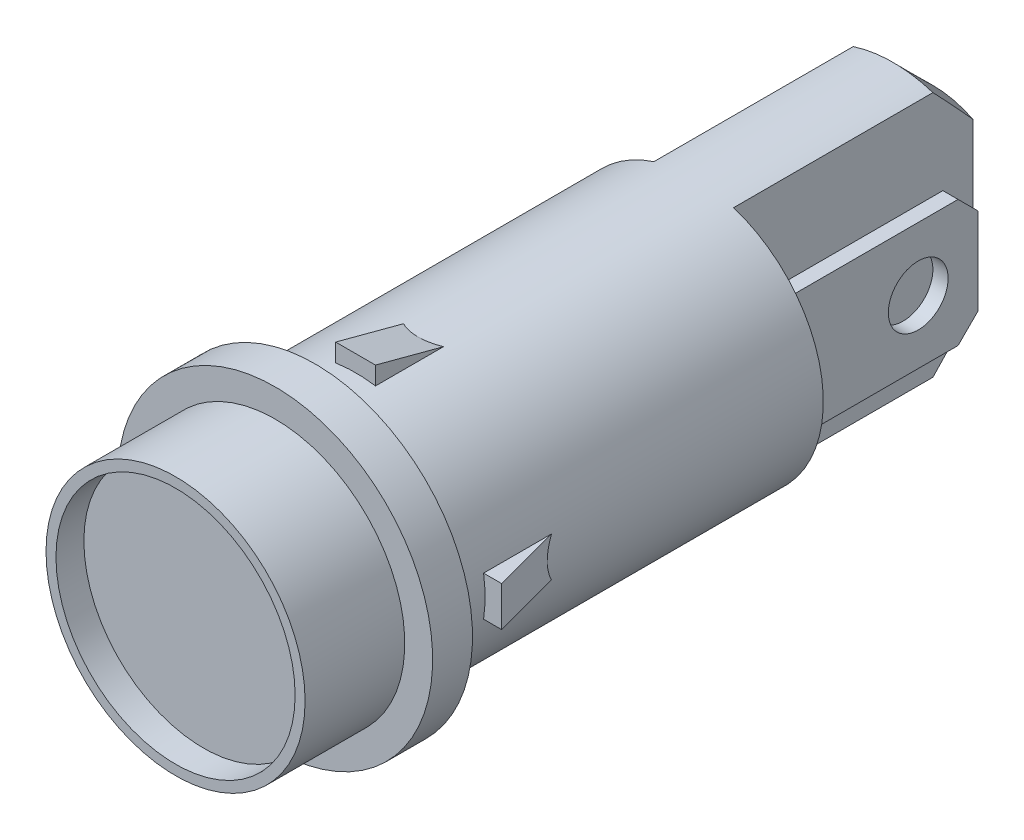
ISO-10303-21;
HEADER;
FILE_DESCRIPTION(('STEP AP214'),'2;1');
FILE_NAME('part.step','',(''),(''),'','','');
FILE_SCHEMA(('AUTOMOTIVE_DESIGN { 1 0 10303 214 1 1 1 1 }'));
ENDSEC;
DATA;
#1=APPLICATION_CONTEXT('core data for automotive mechanical design processes');
#2=APPLICATION_PROTOCOL_DEFINITION('international standard','automotive_design',2000,#1);
#3=PRODUCT_CONTEXT('',#1,'mechanical');
#4=PRODUCT('Part','Part','',(#3));
#5=PRODUCT_RELATED_PRODUCT_CATEGORY('part','',(#4));
#6=PRODUCT_DEFINITION_FORMATION('','',#4);
#7=PRODUCT_DEFINITION_CONTEXT('part definition',#1,'design');
#8=PRODUCT_DEFINITION('design','',#6,#7);
#9=PRODUCT_DEFINITION_SHAPE('','',#8);
#10=(LENGTH_UNIT() NAMED_UNIT(*) SI_UNIT(.MILLI.,.METRE.));
#11=(NAMED_UNIT(*) PLANE_ANGLE_UNIT() SI_UNIT($,.RADIAN.));
#12=(NAMED_UNIT(*) SI_UNIT($,.STERADIAN.) SOLID_ANGLE_UNIT());
#13=UNCERTAINTY_MEASURE_WITH_UNIT(LENGTH_MEASURE(1.E-05),#10,'distance_accuracy_value','');
#14=(GEOMETRIC_REPRESENTATION_CONTEXT(3) GLOBAL_UNCERTAINTY_ASSIGNED_CONTEXT((#13)) GLOBAL_UNIT_ASSIGNED_CONTEXT((#10,
#11,#12)) REPRESENTATION_CONTEXT('',''));
#15=CARTESIAN_POINT('',(0.,0.,0.));
#16=DIRECTION('',(0.,0.,1.));
#17=DIRECTION('',(1.,0.,0.));
#18=AXIS2_PLACEMENT_3D('',#15,#16,#17);
#19=CARTESIAN_POINT('',(-4.262,3.175,2.));
#20=DIRECTION('',(-1.,0.,0.));
#21=DIRECTION('',(0.,0.,1.));
#22=AXIS2_PLACEMENT_3D('',#19,#20,#21);
#23=PLANE('',#22);
#24=DIRECTION('',(0.,-1.,0.));
#25=VECTOR('',#24,1.);
#26=CARTESIAN_POINT('',(-4.262,3.175,2.));
#27=LINE('',#26,#25);
#28=CARTESIAN_POINT('',(-4.262,2.17499999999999,2.));
#29=VERTEX_POINT('',#28);
#30=CARTESIAN_POINT('',(-4.262,-2.175,2.));
#31=VERTEX_POINT('',#30);
#32=EDGE_CURVE('E319',#29,#31,#27,.T.);
#33=ORIENTED_EDGE('',*,*,#32,.T.);
#34=DIRECTION('',(0.,0.707106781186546,-0.707106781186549));
#35=VECTOR('',#34,1.);
#36=CARTESIAN_POINT('',(-4.262,0.499999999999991,-0.675));
#37=LINE('',#36,#35);
#38=CARTESIAN_POINT('',(-4.262,-3.175,3.));
#39=VERTEX_POINT('',#38);
#40=EDGE_CURVE('E435',#31,#39,#37,.F.);
#41=ORIENTED_EDGE('',*,*,#40,.T.);
#42=DIRECTION('',(0.,0.,1.));
#43=VECTOR('',#42,1.);
#44=CARTESIAN_POINT('',(-4.262,-3.175,2.));
#45=LINE('',#44,#43);
#46=CARTESIAN_POINT('',(-4.262,-3.175,12.));
#47=VERTEX_POINT('',#46);
#48=EDGE_CURVE('E325',#39,#47,#45,.T.);
#49=ORIENTED_EDGE('',*,*,#48,.T.);
#50=DIRECTION('',(0.,-1.,0.));
#51=VECTOR('',#50,1.);
#52=CARTESIAN_POINT('',(-4.262,3.175,12.));
#53=LINE('',#52,#51);
#54=CARTESIAN_POINT('',(-4.262,3.175,12.));
#55=VERTEX_POINT('',#54);
#56=EDGE_CURVE('E307',#55,#47,#53,.T.);
#57=ORIENTED_EDGE('',*,*,#56,.F.);
#58=DIRECTION('',(0.,0.,1.));
#59=VECTOR('',#58,1.);
#60=CARTESIAN_POINT('',(-4.262,3.175,2.));
#61=LINE('',#60,#59);
#62=CARTESIAN_POINT('',(-4.262,3.175,3.00000000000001));
#63=VERTEX_POINT('',#62);
#64=EDGE_CURVE('E331',#63,#55,#61,.T.);
#65=ORIENTED_EDGE('',*,*,#64,.F.);
#66=DIRECTION('',(0.,0.707106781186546,0.707106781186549));
#67=VECTOR('',#66,1.);
#68=CARTESIAN_POINT('',(-4.262,2.67499999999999,2.5));
#69=LINE('',#68,#67);
#70=EDGE_CURVE('E433',#63,#29,#69,.F.);
#71=ORIENTED_EDGE('',*,*,#70,.T.);
#72=EDGE_LOOP('',(#33,#41,#49,#57,#65,#71));
#73=FACE_BOUND('',#72,.T.);
#74=CARTESIAN_POINT('',(-4.262,0.,5.));
#75=DIRECTION('',(1.,0.,0.));
#76=DIRECTION('',(0.,0.,-1.));
#77=AXIS2_PLACEMENT_3D('',#74,#75,#76);
#78=CIRCLE('',#77,1.5);
#79=CARTESIAN_POINT('',(-4.262,0.,3.5));
#80=VERTEX_POINT('',#79);
#81=EDGE_CURVE('E301',#80,#80,#78,.T.);
#82=ORIENTED_EDGE('',*,*,#81,.T.);
#83=EDGE_LOOP('',(#82));
#84=FACE_BOUND('',#83,.T.);
#85=ADVANCED_FACE('F42',(#73,#84),#23,.T.);
#86=CARTESIAN_POINT('',(-3.5,3.175,2.));
#87=DIRECTION('',(1.,0.,0.));
#88=DIRECTION('',(0.,0.,-1.));
#89=AXIS2_PLACEMENT_3D('',#86,#87,#88);
#90=PLANE('',#89);
#91=DIRECTION('',(0.,0.,1.));
#92=VECTOR('',#91,1.);
#93=CARTESIAN_POINT('',(-3.5,-3.175,2.));
#94=LINE('',#93,#92);
#95=CARTESIAN_POINT('',(-3.5,-3.175,3.));
#96=VERTEX_POINT('',#95);
#97=CARTESIAN_POINT('',(-3.5,-3.175,12.));
#98=VERTEX_POINT('',#97);
#99=EDGE_CURVE('E327',#96,#98,#94,.T.);
#100=ORIENTED_EDGE('',*,*,#99,.F.);
#101=DIRECTION('',(0.,-0.707106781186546,0.707106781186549));
#102=VECTOR('',#101,1.);
#103=CARTESIAN_POINT('',(-3.5,0.49999999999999,-0.674999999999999));
#104=LINE('',#103,#102);
#105=CARTESIAN_POINT('',(-3.5,-2.175,2.));
#106=VERTEX_POINT('',#105);
#107=EDGE_CURVE('E427',#96,#106,#104,.F.);
#108=ORIENTED_EDGE('',*,*,#107,.T.);
#109=DIRECTION('',(0.,1.,0.));
#110=VECTOR('',#109,1.);
#111=CARTESIAN_POINT('',(-3.5,3.175,2.));
#112=LINE('',#111,#110);
#113=CARTESIAN_POINT('',(-3.5,2.17499999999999,2.));
#114=VERTEX_POINT('',#113);
#115=EDGE_CURVE('E322',#106,#114,#112,.T.);
#116=ORIENTED_EDGE('',*,*,#115,.T.);
#117=DIRECTION('',(0.,-0.707106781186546,-0.707106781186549));
#118=VECTOR('',#117,1.);
#119=CARTESIAN_POINT('',(-3.5,2.67499999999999,2.5));
#120=LINE('',#119,#118);
#121=CARTESIAN_POINT('',(-3.5,3.175,3.00000000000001));
#122=VERTEX_POINT('',#121);
#123=EDGE_CURVE('E425',#114,#122,#120,.F.);
#124=ORIENTED_EDGE('',*,*,#123,.T.);
#125=DIRECTION('',(0.,0.,1.));
#126=VECTOR('',#125,1.);
#127=CARTESIAN_POINT('',(-3.5,3.175,2.));
#128=LINE('',#127,#126);
#129=CARTESIAN_POINT('',(-3.5,3.175,12.));
#130=VERTEX_POINT('',#129);
#131=EDGE_CURVE('E329',#122,#130,#128,.T.);
#132=ORIENTED_EDGE('',*,*,#131,.T.);
#133=DIRECTION('',(0.,1.,0.));
#134=VECTOR('',#133,1.);
#135=CARTESIAN_POINT('',(-3.5,3.175,12.));
#136=LINE('',#135,#134);
#137=EDGE_CURVE('E313',#98,#130,#136,.T.);
#138=ORIENTED_EDGE('',*,*,#137,.F.);
#139=EDGE_LOOP('',(#100,#108,#116,#124,#132,#138));
#140=FACE_BOUND('',#139,.T.);
#141=CARTESIAN_POINT('',(-3.5,0.,5.));
#142=DIRECTION('',(1.,0.,0.));
#143=DIRECTION('',(0.,0.,-1.));
#144=AXIS2_PLACEMENT_3D('',#141,#142,#143);
#145=CIRCLE('',#144,1.5);
#146=CARTESIAN_POINT('',(-3.5,0.,3.5));
#147=VERTEX_POINT('',#146);
#148=EDGE_CURVE('E304',#147,#147,#145,.T.);
#149=ORIENTED_EDGE('',*,*,#148,.F.);
#150=EDGE_LOOP('',(#149));
#151=FACE_BOUND('',#150,.T.);
#152=ADVANCED_FACE('F500',(#140,#151),#90,.T.);
#153=CARTESIAN_POINT('',(2.,-7.9,12.));
#154=DIRECTION('',(0.,0.,1.));
#155=DIRECTION('',(1.,0.,0.));
#156=AXIS2_PLACEMENT_3D('',#153,#154,#155);
#157=PLANE('',#156);
#158=CARTESIAN_POINT('',(0.,0.,12.));
#159=DIRECTION('',(0.,0.,1.));
#160=DIRECTION('',(1.,0.,0.));
#161=AXIS2_PLACEMENT_3D('',#158,#159,#160);
#162=CIRCLE('',#161,6.5);
#163=CARTESIAN_POINT('',(2.,-6.18465843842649,12.));
#164=VERTEX_POINT('',#163);
#165=CARTESIAN_POINT('',(2.,6.18465843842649,12.));
#166=VERTEX_POINT('',#165);
#167=EDGE_CURVE('E389',#164,#166,#162,.T.);
#168=ORIENTED_EDGE('',*,*,#167,.F.);
#169=DIRECTION('',(0.,1.,0.));
#170=VECTOR('',#169,1.);
#171=CARTESIAN_POINT('',(2.,-7.9,12.));
#172=LINE('',#171,#170);
#173=EDGE_CURVE('E369',#164,#166,#172,.T.);
#174=ORIENTED_EDGE('',*,*,#173,.T.);
#175=EDGE_LOOP('',(#168,#174));
#176=FACE_BOUND('',#175,.T.);
#177=DIRECTION('',(0.,-1.,0.));
#178=VECTOR('',#177,1.);
#179=CARTESIAN_POINT('',(4.262,3.175,12.));
#180=LINE('',#179,#178);
#181=CARTESIAN_POINT('',(4.262,3.175,12.));
#182=VERTEX_POINT('',#181);
#183=CARTESIAN_POINT('',(4.262,-3.175,12.));
#184=VERTEX_POINT('',#183);
#185=EDGE_CURVE('E339',#182,#184,#180,.T.);
#186=ORIENTED_EDGE('',*,*,#185,.F.);
#187=DIRECTION('',(1.,0.,0.));
#188=VECTOR('',#187,1.);
#189=CARTESIAN_POINT('',(4.262,3.175,12.));
#190=LINE('',#189,#188);
#191=CARTESIAN_POINT('',(3.5,3.175,12.));
#192=VERTEX_POINT('',#191);
#193=EDGE_CURVE('E348',#192,#182,#190,.T.);
#194=ORIENTED_EDGE('',*,*,#193,.F.);
#195=DIRECTION('',(0.,1.,0.));
#196=VECTOR('',#195,1.);
#197=CARTESIAN_POINT('',(3.5,3.175,12.));
#198=LINE('',#197,#196);
#199=CARTESIAN_POINT('',(3.5,-3.175,12.));
#200=VERTEX_POINT('',#199);
#201=EDGE_CURVE('E345',#200,#192,#198,.T.);
#202=ORIENTED_EDGE('',*,*,#201,.F.);
#203=DIRECTION('',(-1.,0.,0.));
#204=VECTOR('',#203,1.);
#205=CARTESIAN_POINT('',(4.262,-3.175,12.));
#206=LINE('',#205,#204);
#207=EDGE_CURVE('E342',#184,#200,#206,.T.);
#208=ORIENTED_EDGE('',*,*,#207,.F.);
#209=EDGE_LOOP('',(#186,#194,#202,#208));
#210=FACE_BOUND('',#209,.T.);
#211=ADVANCED_FACE('F469',(#176,#210),#157,.F.);
#212=CARTESIAN_POINT('',(0.,0.,36.6));
#213=DIRECTION('',(0.,0.,-1.));
#214=DIRECTION('',(-1.,0.,0.));
#215=AXIS2_PLACEMENT_3D('',#212,#213,#214);
#216=CYLINDRICAL_SURFACE('',#215,6.5);
#217=CARTESIAN_POINT('',(0.,0.,33.));
#218=DIRECTION('',(0.,0.,-1.));
#219=DIRECTION('',(-1.,0.,0.));
#220=AXIS2_PLACEMENT_3D('',#217,#218,#219);
#221=CIRCLE('',#220,6.5);
#222=CARTESIAN_POINT('',(-6.5,0.,33.));
#223=VERTEX_POINT('',#222);
#224=EDGE_CURVE('E386',#223,#223,#221,.T.);
#225=ORIENTED_EDGE('',*,*,#224,.F.);
#226=EDGE_LOOP('',(#225));
#227=FACE_BOUND('',#226,.T.);
#228=CARTESIAN_POINT('',(0.,0.,38.));
#229=DIRECTION('',(0.,0.,1.));
#230=DIRECTION('',(1.,0.,0.));
#231=AXIS2_PLACEMENT_3D('',#228,#229,#230);
#232=CIRCLE('',#231,6.5);
#233=CARTESIAN_POINT('',(6.5,0.,38.));
#234=VERTEX_POINT('',#233);
#235=EDGE_CURVE('E246',#234,#234,#232,.T.);
#236=ORIENTED_EDGE('',*,*,#235,.F.);
#237=EDGE_LOOP('',(#236));
#238=FACE_BOUND('',#237,.T.);
#239=ADVANCED_FACE('F480',(#227,#238),#216,.T.);
#240=CARTESIAN_POINT('',(0.,0.,33.));
#241=DIRECTION('',(0.,0.,-1.));
#242=DIRECTION('',(-1.,0.,0.));
#243=AXIS2_PLACEMENT_3D('',#240,#241,#242);
#244=PLANE('',#243);
#245=CARTESIAN_POINT('',(0.,0.,33.));
#246=DIRECTION('',(0.,0.,-1.));
#247=DIRECTION('',(-1.,0.,0.));
#248=AXIS2_PLACEMENT_3D('',#245,#246,#247);
#249=CIRCLE('',#248,7.9);
#250=CARTESIAN_POINT('',(-7.9,0.,33.));
#251=VERTEX_POINT('',#250);
#252=EDGE_CURVE('E380',#251,#251,#249,.T.);
#253=ORIENTED_EDGE('',*,*,#252,.F.);
#254=EDGE_LOOP('',(#253));
#255=FACE_BOUND('',#254,.T.);
#256=ORIENTED_EDGE('',*,*,#224,.T.);
#257=EDGE_LOOP('',(#256));
#258=FACE_BOUND('',#257,.T.);
#259=ADVANCED_FACE('F476',(#255,#258),#244,.F.);
#260=CARTESIAN_POINT('',(0.,0.,31.));
#261=DIRECTION('',(0.,0.,-1.));
#262=DIRECTION('',(-1.,0.,0.));
#263=AXIS2_PLACEMENT_3D('',#260,#261,#262);
#264=PLANE('',#263);
#265=CARTESIAN_POINT('',(0.,0.,31.));
#266=DIRECTION('',(0.,0.,-1.));
#267=DIRECTION('',(-1.,0.,0.));
#268=AXIS2_PLACEMENT_3D('',#265,#266,#267);
#269=CIRCLE('',#268,7.9);
#270=CARTESIAN_POINT('',(-7.9,0.,31.));
#271=VERTEX_POINT('',#270);
#272=EDGE_CURVE('E375',#271,#271,#269,.T.);
#273=ORIENTED_EDGE('',*,*,#272,.T.);
#274=EDGE_LOOP('',(#273));
#275=FACE_BOUND('',#274,.T.);
#276=CARTESIAN_POINT('',(0.,0.,31.));
#277=DIRECTION('',(0.,0.,-1.));
#278=DIRECTION('',(-1.,0.,0.));
#279=AXIS2_PLACEMENT_3D('',#276,#277,#278);
#280=CIRCLE('',#279,6.5);
#281=CARTESIAN_POINT('',(-6.5,0.,31.));
#282=VERTEX_POINT('',#281);
#283=EDGE_CURVE('E383',#282,#282,#280,.T.);
#284=ORIENTED_EDGE('',*,*,#283,.F.);
#285=EDGE_LOOP('',(#284));
#286=FACE_BOUND('',#285,.T.);
#287=ADVANCED_FACE('F471',(#275,#286),#264,.T.);
#288=CARTESIAN_POINT('',(0.,0.,33.));
#289=DIRECTION('',(0.,0.,-1.));
#290=DIRECTION('',(-1.,0.,0.));
#291=AXIS2_PLACEMENT_3D('',#288,#289,#290);
#292=CYLINDRICAL_SURFACE('',#291,7.9);
#293=ORIENTED_EDGE('',*,*,#252,.T.);
#294=EDGE_LOOP('',(#293));
#295=FACE_BOUND('',#294,.T.);
#296=ORIENTED_EDGE('',*,*,#272,.F.);
#297=EDGE_LOOP('',(#296));
#298=FACE_BOUND('',#297,.T.);
#299=ADVANCED_FACE('F475',(#295,#298),#292,.T.);
#300=CARTESIAN_POINT('',(0.,0.,0.));
#301=DIRECTION('',(0.,0.,1.));
#302=DIRECTION('',(1.,0.,0.));
#303=AXIS2_PLACEMENT_3D('',#300,#301,#302);
#304=PLANE('',#303);
#305=DIRECTION('',(0.,1.,0.));
#306=VECTOR('',#305,1.);
#307=CARTESIAN_POINT('',(2.,-7.9,0.));
#308=LINE('',#307,#306);
#309=CARTESIAN_POINT('',(2.,-4.03112887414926,0.));
#310=VERTEX_POINT('',#309);
#311=CARTESIAN_POINT('',(2.,4.03112887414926,0.));
#312=VERTEX_POINT('',#311);
#313=EDGE_CURVE('E372',#310,#312,#308,.T.);
#314=ORIENTED_EDGE('',*,*,#313,.F.);
#315=CARTESIAN_POINT('',(0.,0.,0.));
#316=DIRECTION('',(0.,0.,1.));
#317=DIRECTION('',(1.,0.,0.));
#318=AXIS2_PLACEMENT_3D('',#315,#316,#317);
#319=CIRCLE('',#318,4.49999999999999);
#320=CARTESIAN_POINT('',(-2.,-4.03112887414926,0.));
#321=VERTEX_POINT('',#320);
#322=EDGE_CURVE('E622',#310,#321,#319,.F.);
#323=ORIENTED_EDGE('',*,*,#322,.T.);
#324=DIRECTION('',(0.,1.,0.));
#325=VECTOR('',#324,1.);
#326=CARTESIAN_POINT('',(-2.,-7.9,0.));
#327=LINE('',#326,#325);
#328=CARTESIAN_POINT('',(-2.,4.03112887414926,0.));
#329=VERTEX_POINT('',#328);
#330=EDGE_CURVE('E366',#321,#329,#327,.T.);
#331=ORIENTED_EDGE('',*,*,#330,.T.);
#332=CARTESIAN_POINT('',(0.,0.,0.));
#333=DIRECTION('',(0.,0.,1.));
#334=DIRECTION('',(1.,0.,0.));
#335=AXIS2_PLACEMENT_3D('',#332,#333,#334);
#336=CIRCLE('',#335,4.49999999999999);
#337=EDGE_CURVE('E624',#329,#312,#336,.F.);
#338=ORIENTED_EDGE('',*,*,#337,.T.);
#339=EDGE_LOOP('',(#314,#323,#331,#338));
#340=FACE_BOUND('',#339,.T.);
#341=ADVANCED_FACE('F484',(#340),#304,.F.);
#342=CARTESIAN_POINT('',(0.,0.,28.968));
#343=DIRECTION('',(0.,0.,-1.));
#344=DIRECTION('',(0.,1.,0.));
#345=AXIS2_PLACEMENT_3D('',#342,#343,#344);
#346=CIRCLE('',#345,6.5);
#347=CARTESIAN_POINT('',(-0.999999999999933,6.42261628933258,28.968));
#348=VERTEX_POINT('',#347);
#349=CARTESIAN_POINT('',(1.00000000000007,6.42261628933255,28.968));
#350=VERTEX_POINT('',#349);
#351=EDGE_CURVE('E57',#348,#350,#346,.T.);
#352=ORIENTED_EDGE('',*,*,#351,.F.);
#353=DIRECTION('',(0.,0.,-1.));
#354=VECTOR('',#353,1.);
#355=CARTESIAN_POINT('',(-0.999999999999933,6.42261628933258,36.6));
#356=LINE('',#355,#354);
#357=CARTESIAN_POINT('',(-0.999999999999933,6.42261628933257,25.5591735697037));
#358=VERTEX_POINT('',#357);
#359=EDGE_CURVE('E50',#348,#358,#356,.T.);
#360=ORIENTED_EDGE('',*,*,#359,.T.);
#361=CARTESIAN_POINT('',(0.,0.,1.42256719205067));
#362=DIRECTION('',(0.,-0.966372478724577,0.257146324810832));
#363=DIRECTION('',(0.,-0.257146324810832,-0.966372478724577));
#364=AXIS2_PLACEMENT_3D('',#361,#362,#363);
#365=ELLIPSE('',#364,25.2774369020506,6.5);
#366=CARTESIAN_POINT('',(1.00000000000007,6.42261628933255,25.5591735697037));
#367=VERTEX_POINT('',#366);
#368=EDGE_CURVE('E715',#367,#358,#365,.T.);
#369=ORIENTED_EDGE('',*,*,#368,.F.);
#370=DIRECTION('',(0.,0.,-1.));
#371=VECTOR('',#370,1.);
#372=CARTESIAN_POINT('',(1.00000000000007,6.42261628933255,36.6));
#373=LINE('',#372,#371);
#374=EDGE_CURVE('E256',#350,#367,#373,.T.);
#375=ORIENTED_EDGE('',*,*,#374,.F.);
#376=EDGE_LOOP('',(#352,#360,#369,#375));
#377=FACE_BOUND('',#376,.T.);
#378=CARTESIAN_POINT('',(0.,0.,28.968));
#379=DIRECTION('',(0.,0.,-1.));
#380=DIRECTION('',(-1.,0.,0.));
#381=AXIS2_PLACEMENT_3D('',#378,#379,#380);
#382=CIRCLE('',#381,6.5);
#383=CARTESIAN_POINT('',(-6.42261628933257,-0.999999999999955,28.968));
#384=VERTEX_POINT('',#383);
#385=CARTESIAN_POINT('',(-6.42261628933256,1.00000000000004,28.968));
#386=VERTEX_POINT('',#385);
#387=EDGE_CURVE('E666',#384,#386,#382,.T.);
#388=ORIENTED_EDGE('',*,*,#387,.F.);
#389=DIRECTION('',(0.,0.,-1.));
#390=VECTOR('',#389,1.);
#391=CARTESIAN_POINT('',(-6.42261628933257,-0.999999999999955,36.6));
#392=LINE('',#391,#390);
#393=CARTESIAN_POINT('',(-6.42261628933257,-0.999999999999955,25.5591735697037));
#394=VERTEX_POINT('',#393);
#395=EDGE_CURVE('E712',#384,#394,#392,.T.);
#396=ORIENTED_EDGE('',*,*,#395,.T.);
#397=CARTESIAN_POINT('',(0.,0.,1.42256719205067));
#398=DIRECTION('',(0.966372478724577,0.,0.257146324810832));
#399=DIRECTION('',(0.257146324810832,0.,-0.966372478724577));
#400=AXIS2_PLACEMENT_3D('',#397,#398,#399);
#401=ELLIPSE('',#400,25.2774369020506,6.5);
#402=CARTESIAN_POINT('',(-6.42261628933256,1.00000000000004,25.5591735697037));
#403=VERTEX_POINT('',#402);
#404=EDGE_CURVE('E708',#403,#394,#401,.T.);
#405=ORIENTED_EDGE('',*,*,#404,.F.);
#406=DIRECTION('',(0.,0.,-1.));
#407=VECTOR('',#406,1.);
#408=CARTESIAN_POINT('',(-6.42261628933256,1.00000000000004,36.6));
#409=LINE('',#408,#407);
#410=EDGE_CURVE('E705',#386,#403,#409,.T.);
#411=ORIENTED_EDGE('',*,*,#410,.F.);
#412=EDGE_LOOP('',(#388,#396,#405,#411));
#413=FACE_BOUND('',#412,.T.);
#414=CARTESIAN_POINT('',(0.,0.,28.968));
#415=DIRECTION('',(0.,0.,-1.));
#416=DIRECTION('',(0.,1.,0.));
#417=AXIS2_PLACEMENT_3D('',#414,#415,#416);
#418=CIRCLE('',#417,6.5);
#419=CARTESIAN_POINT('',(0.999999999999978,-6.42261628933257,28.968));
#420=VERTEX_POINT('',#419);
#421=CARTESIAN_POINT('',(-1.00000000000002,-6.42261628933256,28.968));
#422=VERTEX_POINT('',#421);
#423=EDGE_CURVE('E670',#420,#422,#418,.T.);
#424=ORIENTED_EDGE('',*,*,#423,.F.);
#425=DIRECTION('',(0.,0.,-1.));
#426=VECTOR('',#425,1.);
#427=CARTESIAN_POINT('',(0.999999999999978,-6.42261628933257,36.6));
#428=LINE('',#427,#426);
#429=CARTESIAN_POINT('',(0.999999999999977,-6.42261628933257,25.5591735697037));
#430=VERTEX_POINT('',#429);
#431=EDGE_CURVE('E703',#420,#430,#428,.T.);
#432=ORIENTED_EDGE('',*,*,#431,.T.);
#433=CARTESIAN_POINT('',(0.,0.,1.42256719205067));
#434=DIRECTION('',(0.,0.966372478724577,0.257146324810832));
#435=DIRECTION('',(0.,0.257146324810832,-0.966372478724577));
#436=AXIS2_PLACEMENT_3D('',#433,#434,#435);
#437=ELLIPSE('',#436,25.2774369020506,6.5);
#438=CARTESIAN_POINT('',(-1.00000000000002,-6.42261628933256,25.5591735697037));
#439=VERTEX_POINT('',#438);
#440=EDGE_CURVE('E699',#439,#430,#437,.T.);
#441=ORIENTED_EDGE('',*,*,#440,.F.);
#442=DIRECTION('',(0.,0.,-1.));
#443=VECTOR('',#442,1.);
#444=CARTESIAN_POINT('',(-1.00000000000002,-6.42261628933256,36.6));
#445=LINE('',#444,#443);
#446=EDGE_CURVE('E690',#422,#439,#445,.T.);
#447=ORIENTED_EDGE('',*,*,#446,.F.);
#448=EDGE_LOOP('',(#424,#432,#441,#447));
#449=FACE_BOUND('',#448,.T.);
#450=CARTESIAN_POINT('',(0.,0.,28.968));
#451=DIRECTION('',(0.,0.,-1.));
#452=DIRECTION('',(-1.,0.,0.));
#453=AXIS2_PLACEMENT_3D('',#450,#451,#452);
#454=CIRCLE('',#453,6.5);
#455=CARTESIAN_POINT('',(6.42261628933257,1.,28.968));
#456=VERTEX_POINT('',#455);
#457=CARTESIAN_POINT('',(6.42261628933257,-1.,28.968));
#458=VERTEX_POINT('',#457);
#459=EDGE_CURVE('E674',#456,#458,#454,.T.);
#460=ORIENTED_EDGE('',*,*,#459,.F.);
#461=DIRECTION('',(0.,0.,-1.));
#462=VECTOR('',#461,1.);
#463=CARTESIAN_POINT('',(6.42261628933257,1.,36.6));
#464=LINE('',#463,#462);
#465=CARTESIAN_POINT('',(6.42261628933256,1.,25.5591735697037));
#466=VERTEX_POINT('',#465);
#467=EDGE_CURVE('E678',#456,#466,#464,.T.);
#468=ORIENTED_EDGE('',*,*,#467,.T.);
#469=CARTESIAN_POINT('',(0.,0.,1.42256719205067));
#470=DIRECTION('',(-0.966372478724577,0.,0.257146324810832));
#471=DIRECTION('',(-0.257146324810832,0.,-0.966372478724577));
#472=AXIS2_PLACEMENT_3D('',#469,#470,#471);
#473=ELLIPSE('',#472,25.2774369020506,6.5);
#474=CARTESIAN_POINT('',(6.42261628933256,-1.,25.5591735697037));
#475=VERTEX_POINT('',#474);
#476=EDGE_CURVE('E684',#475,#466,#473,.T.);
#477=ORIENTED_EDGE('',*,*,#476,.F.);
#478=DIRECTION('',(0.,0.,-1.));
#479=VECTOR('',#478,1.);
#480=CARTESIAN_POINT('',(6.42261628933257,-1.,36.6));
#481=LINE('',#480,#479);
#482=EDGE_CURVE('E561',#458,#475,#481,.T.);
#483=ORIENTED_EDGE('',*,*,#482,.F.);
#484=EDGE_LOOP('',(#460,#468,#477,#483));
#485=FACE_BOUND('',#484,.T.);
#486=ORIENTED_EDGE('',*,*,#283,.T.);
#487=EDGE_LOOP('',(#486));
#488=FACE_BOUND('',#487,.T.);
#489=DIRECTION('',(0.,0.,-1.));
#490=VECTOR('',#489,1.);
#491=CARTESIAN_POINT('',(-2.00000000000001,-6.18465843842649,36.6));
#492=LINE('',#491,#490);
#493=CARTESIAN_POINT('',(-2.,-6.18465843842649,12.));
#494=VERTEX_POINT('',#493);
#495=CARTESIAN_POINT('',(-2.00000000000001,-6.18465843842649,2.));
#496=VERTEX_POINT('',#495);
#497=EDGE_CURVE('E399',#494,#496,#492,.T.);
#498=ORIENTED_EDGE('',*,*,#497,.T.);
#499=CARTESIAN_POINT('',(0.,0.,2.));
#500=DIRECTION('',(0.,0.,1.));
#501=DIRECTION('',(1.,0.,0.));
#502=AXIS2_PLACEMENT_3D('',#499,#500,#501);
#503=CIRCLE('',#502,6.5);
#504=CARTESIAN_POINT('',(2.00000000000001,-6.18465843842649,2.));
#505=VERTEX_POINT('',#504);
#506=EDGE_CURVE('E443',#496,#505,#503,.T.);
#507=ORIENTED_EDGE('',*,*,#506,.T.);
#508=DIRECTION('',(0.,0.,-1.));
#509=VECTOR('',#508,1.);
#510=CARTESIAN_POINT('',(2.00000000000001,-6.18465843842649,36.6));
#511=LINE('',#510,#509);
#512=EDGE_CURVE('E391',#505,#164,#511,.F.);
#513=ORIENTED_EDGE('',*,*,#512,.T.);
#514=ORIENTED_EDGE('',*,*,#167,.T.);
#515=DIRECTION('',(0.,0.,-1.));
#516=VECTOR('',#515,1.);
#517=CARTESIAN_POINT('',(2.00000000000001,6.18465843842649,36.6));
#518=LINE('',#517,#516);
#519=CARTESIAN_POINT('',(2.00000000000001,6.18465843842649,2.));
#520=VERTEX_POINT('',#519);
#521=EDGE_CURVE('E393',#166,#520,#518,.T.);
#522=ORIENTED_EDGE('',*,*,#521,.T.);
#523=CARTESIAN_POINT('',(0.,0.,2.));
#524=DIRECTION('',(0.,0.,1.));
#525=DIRECTION('',(1.,0.,0.));
#526=AXIS2_PLACEMENT_3D('',#523,#524,#525);
#527=CIRCLE('',#526,6.5);
#528=CARTESIAN_POINT('',(-2.00000000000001,6.18465843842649,2.));
#529=VERTEX_POINT('',#528);
#530=EDGE_CURVE('E440',#520,#529,#527,.T.);
#531=ORIENTED_EDGE('',*,*,#530,.T.);
#532=DIRECTION('',(0.,0.,-1.));
#533=VECTOR('',#532,1.);
#534=CARTESIAN_POINT('',(-2.00000000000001,6.18465843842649,36.6));
#535=LINE('',#534,#533);
#536=CARTESIAN_POINT('',(-2.,6.18465843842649,12.));
#537=VERTEX_POINT('',#536);
#538=EDGE_CURVE('E402',#529,#537,#535,.F.);
#539=ORIENTED_EDGE('',*,*,#538,.T.);
#540=CARTESIAN_POINT('',(0.,0.,12.));
#541=DIRECTION('',(0.,0.,1.));
#542=DIRECTION('',(1.,0.,0.));
#543=AXIS2_PLACEMENT_3D('',#540,#541,#542);
#544=CIRCLE('',#543,6.5);
#545=EDGE_CURVE('E396',#537,#494,#544,.T.);
#546=ORIENTED_EDGE('',*,*,#545,.T.);
#547=EDGE_LOOP('',(#498,#507,#513,#514,#522,#531,#539,#546));
#548=FACE_BOUND('',#547,.T.);
#549=ADVANCED_FACE('F44',(#377,#413,#449,#485,#488,#548),#216,.T.);
#550=CARTESIAN_POINT('',(2.,-7.9,0.));
#551=DIRECTION('',(-1.,0.,0.));
#552=DIRECTION('',(0.,0.,1.));
#553=AXIS2_PLACEMENT_3D('',#550,#551,#552);
#554=PLANE('',#553);
#555=ORIENTED_EDGE('',*,*,#512,.F.);
#556=CARTESIAN_POINT('',(2.00000000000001,-6.18465843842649,2.));
#557=CARTESIAN_POINT('',(2.,-6.0072036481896,1.83118359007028));
#558=CARTESIAN_POINT('',(2.,-5.8294320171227,1.66269766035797));
#559=CARTESIAN_POINT('',(2.,-5.47300822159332,1.32667911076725));
#560=CARTESIAN_POINT('',(2.,-5.29435610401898,1.15914644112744));
#561=CARTESIAN_POINT('',(2.,-4.93590106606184,0.825304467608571));
#562=CARTESIAN_POINT('',(2.,-4.75609811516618,0.658995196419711));
#563=CARTESIAN_POINT('',(2.,-4.48522439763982,0.410797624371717));
#564=CARTESIAN_POINT('',(2.,-4.39473587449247,0.328273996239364));
#565=CARTESIAN_POINT('',(2.,-4.21329686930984,0.163734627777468));
#566=CARTESIAN_POINT('',(2.,-4.12234638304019,0.0817188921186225));
#567=CARTESIAN_POINT('',(2.,-4.03112887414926,0.));
#568=B_SPLINE_CURVE_WITH_KNOTS('',3,(#556,#557,#558,#559,#560,#561,#562,#563,#564,#565,#566,
#567),.UNSPECIFIED.,.F.,.F.,(4,2,2,2,2,4),(0.,0.734782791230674,1.46952686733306,
2.20429050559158,2.57169170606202,2.93909628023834),.UNSPECIFIED.);
#569=EDGE_CURVE('E453',#505,#310,#568,.T.);
#570=ORIENTED_EDGE('',*,*,#569,.T.);
#571=ORIENTED_EDGE('',*,*,#313,.T.);
#572=CARTESIAN_POINT('',(2.,4.03112887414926,0.));
#573=CARTESIAN_POINT('',(2.,4.12234638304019,0.0817188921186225));
#574=CARTESIAN_POINT('',(2.,4.21329686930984,0.163734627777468));
#575=CARTESIAN_POINT('',(2.,4.39473587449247,0.328273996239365));
#576=CARTESIAN_POINT('',(2.,4.48522439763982,0.410797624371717));
#577=CARTESIAN_POINT('',(2.,4.75609811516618,0.658995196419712));
#578=CARTESIAN_POINT('',(2.,4.93590106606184,0.825304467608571));
#579=CARTESIAN_POINT('',(2.,5.29435610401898,1.15914644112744));
#580=CARTESIAN_POINT('',(2.,5.47300822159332,1.32667911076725));
#581=CARTESIAN_POINT('',(2.,5.8294320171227,1.66269766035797));
#582=CARTESIAN_POINT('',(2.,6.00720364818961,1.83118359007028));
#583=CARTESIAN_POINT('',(2.,6.18465843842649,2.));
#584=B_SPLINE_CURVE_WITH_KNOTS('',3,(#572,#573,#574,#575,#576,#577,#578,#579,#580,#581,#582,
#583),.UNSPECIFIED.,.F.,.F.,(4,2,2,2,2,4),(0.,0.367404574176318,0.73480577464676,
1.46956941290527,2.20431348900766,2.93909628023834),.UNSPECIFIED.);
#585=EDGE_CURVE('E446',#312,#520,#584,.T.);
#586=ORIENTED_EDGE('',*,*,#585,.T.);
#587=ORIENTED_EDGE('',*,*,#521,.F.);
#588=ORIENTED_EDGE('',*,*,#173,.F.);
#589=EDGE_LOOP('',(#555,#570,#571,#586,#587,#588));
#590=FACE_BOUND('',#589,.T.);
#591=ADVANCED_FACE('F462',(#590),#554,.F.);
#592=CARTESIAN_POINT('',(-2.,-7.9,0.));
#593=DIRECTION('',(1.,0.,0.));
#594=DIRECTION('',(0.,0.,-1.));
#595=AXIS2_PLACEMENT_3D('',#592,#593,#594);
#596=PLANE('',#595);
#597=ORIENTED_EDGE('',*,*,#330,.F.);
#598=CARTESIAN_POINT('',(-2.,-4.03112887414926,0.));
#599=CARTESIAN_POINT('',(-2.,-4.12234638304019,0.0817188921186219));
#600=CARTESIAN_POINT('',(-2.,-4.21329686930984,0.163734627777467));
#601=CARTESIAN_POINT('',(-2.,-4.39473587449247,0.328273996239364));
#602=CARTESIAN_POINT('',(-2.,-4.48522439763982,0.410797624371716));
#603=CARTESIAN_POINT('',(-2.,-4.75609811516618,0.658995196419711));
#604=CARTESIAN_POINT('',(-2.,-4.93590106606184,0.82530446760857));
#605=CARTESIAN_POINT('',(-2.,-5.29435610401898,1.15914644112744));
#606=CARTESIAN_POINT('',(-2.,-5.47300822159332,1.32667911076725));
#607=CARTESIAN_POINT('',(-2.,-5.8294320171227,1.66269766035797));
#608=CARTESIAN_POINT('',(-2.,-6.0072036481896,1.83118359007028));
#609=CARTESIAN_POINT('',(-2.,-6.18465843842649,2.));
#610=B_SPLINE_CURVE_WITH_KNOTS('',3,(#598,#599,#600,#601,#602,#603,#604,#605,#606,#607,#608,
#609),.UNSPECIFIED.,.F.,.F.,(4,2,2,2,2,4),(0.,0.367404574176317,0.734805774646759,
1.46956941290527,2.20431348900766,2.93909628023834),.UNSPECIFIED.);
#611=EDGE_CURVE('E556',#321,#496,#610,.T.);
#612=ORIENTED_EDGE('',*,*,#611,.T.);
#613=ORIENTED_EDGE('',*,*,#497,.F.);
#614=DIRECTION('',(0.,1.,0.));
#615=VECTOR('',#614,1.);
#616=CARTESIAN_POINT('',(-2.,-7.9,12.));
#617=LINE('',#616,#615);
#618=EDGE_CURVE('E365',#494,#537,#617,.T.);
#619=ORIENTED_EDGE('',*,*,#618,.T.);
#620=ORIENTED_EDGE('',*,*,#538,.F.);
#621=CARTESIAN_POINT('',(-2.00000000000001,6.18465843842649,2.));
#622=CARTESIAN_POINT('',(-2.,6.0072036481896,1.83118359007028));
#623=CARTESIAN_POINT('',(-2.,5.8294320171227,1.66269766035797));
#624=CARTESIAN_POINT('',(-2.,5.47300822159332,1.32667911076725));
#625=CARTESIAN_POINT('',(-2.,5.29435610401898,1.15914644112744));
#626=CARTESIAN_POINT('',(-2.,4.93590106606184,0.825304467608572));
#627=CARTESIAN_POINT('',(-2.,4.75609811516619,0.658995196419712));
#628=CARTESIAN_POINT('',(-2.,4.48522439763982,0.410797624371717));
#629=CARTESIAN_POINT('',(-2.,4.39473587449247,0.328273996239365));
#630=CARTESIAN_POINT('',(-2.,4.21329686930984,0.163734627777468));
#631=CARTESIAN_POINT('',(-2.,4.12234638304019,0.0817188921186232));
#632=CARTESIAN_POINT('',(-2.,4.03112887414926,0.));
#633=B_SPLINE_CURVE_WITH_KNOTS('',3,(#621,#622,#623,#624,#625,#626,#627,#628,#629,#630,#631,
#632),.UNSPECIFIED.,.F.,.F.,(4,2,2,2,2,4),(0.,0.734782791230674,1.46952686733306,
2.20429050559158,2.57169170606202,2.93909628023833),.UNSPECIFIED.);
#634=EDGE_CURVE('E550',#529,#329,#633,.T.);
#635=ORIENTED_EDGE('',*,*,#634,.T.);
#636=EDGE_LOOP('',(#597,#612,#613,#619,#620,#635));
#637=FACE_BOUND('',#636,.T.);
#638=ADVANCED_FACE('F467',(#637),#596,.F.);
#639=CARTESIAN_POINT('',(-2.,-7.9,12.));
#640=DIRECTION('',(0.,0.,1.));
#641=DIRECTION('',(1.,0.,0.));
#642=AXIS2_PLACEMENT_3D('',#639,#640,#641);
#643=PLANE('',#642);
#644=DIRECTION('',(-1.,0.,0.));
#645=VECTOR('',#644,1.);
#646=CARTESIAN_POINT('',(-4.262,3.175,12.));
#647=LINE('',#646,#645);
#648=EDGE_CURVE('E310',#130,#55,#647,.T.);
#649=ORIENTED_EDGE('',*,*,#648,.T.);
#650=ORIENTED_EDGE('',*,*,#56,.T.);
#651=DIRECTION('',(1.,0.,0.));
#652=VECTOR('',#651,1.);
#653=CARTESIAN_POINT('',(-4.262,-3.175,12.));
#654=LINE('',#653,#652);
#655=EDGE_CURVE('E316',#47,#98,#654,.T.);
#656=ORIENTED_EDGE('',*,*,#655,.T.);
#657=ORIENTED_EDGE('',*,*,#137,.T.);
#658=EDGE_LOOP('',(#649,#650,#656,#657));
#659=FACE_BOUND('',#658,.T.);
#660=ORIENTED_EDGE('',*,*,#618,.F.);
#661=ORIENTED_EDGE('',*,*,#545,.F.);
#662=EDGE_LOOP('',(#660,#661));
#663=FACE_BOUND('',#662,.T.);
#664=ADVANCED_FACE('F543',(#659,#663),#643,.F.);
#665=CARTESIAN_POINT('',(4.262,3.175,2.));
#666=DIRECTION('',(-1.,0.,0.));
#667=DIRECTION('',(0.,0.,1.));
#668=AXIS2_PLACEMENT_3D('',#665,#666,#667);
#669=PLANE('',#668);
#670=CARTESIAN_POINT('',(4.262,0.,5.));
#671=DIRECTION('',(1.,0.,0.));
#672=DIRECTION('',(0.,0.,-1.));
#673=AXIS2_PLACEMENT_3D('',#670,#671,#672);
#674=CIRCLE('',#673,1.5);
#675=CARTESIAN_POINT('',(4.262,0.,3.5));
#676=VERTEX_POINT('',#675);
#677=EDGE_CURVE('E336',#676,#676,#674,.T.);
#678=ORIENTED_EDGE('',*,*,#677,.F.);
#679=EDGE_LOOP('',(#678));
#680=FACE_BOUND('',#679,.T.);
#681=DIRECTION('',(0.,0.,1.));
#682=VECTOR('',#681,1.);
#683=CARTESIAN_POINT('',(4.262,-3.175,2.));
#684=LINE('',#683,#682);
#685=CARTESIAN_POINT('',(4.262,-3.175,3.));
#686=VERTEX_POINT('',#685);
#687=EDGE_CURVE('E363',#686,#184,#684,.T.);
#688=ORIENTED_EDGE('',*,*,#687,.F.);
#689=DIRECTION('',(0.,0.707106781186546,-0.707106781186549));
#690=VECTOR('',#689,1.);
#691=CARTESIAN_POINT('',(4.262,-2.175,2.));
#692=LINE('',#691,#690);
#693=CARTESIAN_POINT('',(4.262,-2.175,2.));
#694=VERTEX_POINT('',#693);
#695=EDGE_CURVE('E418',#686,#694,#692,.T.);
#696=ORIENTED_EDGE('',*,*,#695,.T.);
#697=DIRECTION('',(0.,-1.,0.));
#698=VECTOR('',#697,1.);
#699=CARTESIAN_POINT('',(4.262,3.175,2.));
#700=LINE('',#699,#698);
#701=CARTESIAN_POINT('',(4.262,2.17499999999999,2.));
#702=VERTEX_POINT('',#701);
#703=EDGE_CURVE('E351',#702,#694,#700,.T.);
#704=ORIENTED_EDGE('',*,*,#703,.F.);
#705=DIRECTION('',(0.,0.707106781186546,0.707106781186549));
#706=VECTOR('',#705,1.);
#707=CARTESIAN_POINT('',(4.262,2.17499999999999,2.));
#708=LINE('',#707,#706);
#709=CARTESIAN_POINT('',(4.262,3.175,3.00000000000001));
#710=VERTEX_POINT('',#709);
#711=EDGE_CURVE('E416',#702,#710,#708,.T.);
#712=ORIENTED_EDGE('',*,*,#711,.T.);
#713=DIRECTION('',(0.,0.,1.));
#714=VECTOR('',#713,1.);
#715=CARTESIAN_POINT('',(4.262,3.175,2.));
#716=LINE('',#715,#714);
#717=EDGE_CURVE('E357',#710,#182,#716,.T.);
#718=ORIENTED_EDGE('',*,*,#717,.T.);
#719=ORIENTED_EDGE('',*,*,#185,.T.);
#720=EDGE_LOOP('',(#688,#696,#704,#712,#718,#719));
#721=FACE_BOUND('',#720,.T.);
#722=ADVANCED_FACE('F539',(#680,#721),#669,.F.);
#723=CARTESIAN_POINT('',(4.262,-3.175,2.));
#724=DIRECTION('',(0.,1.,0.));
#725=DIRECTION('',(0.,0.,1.));
#726=AXIS2_PLACEMENT_3D('',#723,#724,#725);
#727=PLANE('',#726);
#728=DIRECTION('',(0.,0.,1.));
#729=VECTOR('',#728,1.);
#730=CARTESIAN_POINT('',(3.5,-3.175,2.));
#731=LINE('',#730,#729);
#732=CARTESIAN_POINT('',(3.5,-3.175,3.));
#733=VERTEX_POINT('',#732);
#734=EDGE_CURVE('E361',#733,#200,#731,.T.);
#735=ORIENTED_EDGE('',*,*,#734,.F.);
#736=DIRECTION('',(1.,0.,0.));
#737=VECTOR('',#736,1.);
#738=CARTESIAN_POINT('',(4.262,-3.175,3.));
#739=LINE('',#738,#737);
#740=EDGE_CURVE('E414',#733,#686,#739,.T.);
#741=ORIENTED_EDGE('',*,*,#740,.T.);
#742=ORIENTED_EDGE('',*,*,#687,.T.);
#743=ORIENTED_EDGE('',*,*,#207,.T.);
#744=EDGE_LOOP('',(#735,#741,#742,#743));
#745=FACE_BOUND('',#744,.T.);
#746=ADVANCED_FACE('F535',(#745),#727,.F.);
#747=CARTESIAN_POINT('',(3.5,3.175,2.));
#748=DIRECTION('',(1.,0.,0.));
#749=DIRECTION('',(0.,0.,-1.));
#750=AXIS2_PLACEMENT_3D('',#747,#748,#749);
#751=PLANE('',#750);
#752=CARTESIAN_POINT('',(3.5,0.,5.));
#753=DIRECTION('',(1.,0.,0.));
#754=DIRECTION('',(0.,0.,-1.));
#755=AXIS2_PLACEMENT_3D('',#752,#753,#754);
#756=CIRCLE('',#755,1.5);
#757=CARTESIAN_POINT('',(3.5,0.,3.5));
#758=VERTEX_POINT('',#757);
#759=EDGE_CURVE('E333',#758,#758,#756,.F.);
#760=ORIENTED_EDGE('',*,*,#759,.F.);
#761=EDGE_LOOP('',(#760));
#762=FACE_BOUND('',#761,.T.);
#763=DIRECTION('',(0.,1.,0.));
#764=VECTOR('',#763,1.);
#765=CARTESIAN_POINT('',(3.5,3.175,2.));
#766=LINE('',#765,#764);
#767=CARTESIAN_POINT('',(3.5,-2.175,2.));
#768=VERTEX_POINT('',#767);
#769=CARTESIAN_POINT('',(3.5,2.17499999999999,2.));
#770=VERTEX_POINT('',#769);
#771=EDGE_CURVE('E354',#768,#770,#766,.T.);
#772=ORIENTED_EDGE('',*,*,#771,.F.);
#773=DIRECTION('',(0.,-0.707106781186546,0.707106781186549));
#774=VECTOR('',#773,1.);
#775=CARTESIAN_POINT('',(3.5,-2.175,2.));
#776=LINE('',#775,#774);
#777=EDGE_CURVE('E412',#768,#733,#776,.T.);
#778=ORIENTED_EDGE('',*,*,#777,.T.);
#779=ORIENTED_EDGE('',*,*,#734,.T.);
#780=ORIENTED_EDGE('',*,*,#201,.T.);
#781=DIRECTION('',(0.,0.,1.));
#782=VECTOR('',#781,1.);
#783=CARTESIAN_POINT('',(3.5,3.175,2.));
#784=LINE('',#783,#782);
#785=CARTESIAN_POINT('',(3.5,3.175,3.00000000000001));
#786=VERTEX_POINT('',#785);
#787=EDGE_CURVE('E359',#786,#192,#784,.T.);
#788=ORIENTED_EDGE('',*,*,#787,.F.);
#789=DIRECTION('',(0.,-0.707106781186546,-0.707106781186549));
#790=VECTOR('',#789,1.);
#791=CARTESIAN_POINT('',(3.5,2.17499999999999,2.));
#792=LINE('',#791,#790);
#793=EDGE_CURVE('E410',#786,#770,#792,.T.);
#794=ORIENTED_EDGE('',*,*,#793,.T.);
#795=EDGE_LOOP('',(#772,#778,#779,#780,#788,#794));
#796=FACE_BOUND('',#795,.T.);
#797=ADVANCED_FACE('F531',(#762,#796),#751,.F.);
#798=CARTESIAN_POINT('',(4.262,3.175,2.));
#799=DIRECTION('',(0.,-1.,0.));
#800=DIRECTION('',(1.,0.,0.));
#801=AXIS2_PLACEMENT_3D('',#798,#799,#800);
#802=PLANE('',#801);
#803=ORIENTED_EDGE('',*,*,#717,.F.);
#804=DIRECTION('',(-1.,0.,0.));
#805=VECTOR('',#804,1.);
#806=CARTESIAN_POINT('',(3.5,3.175,3.00000000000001));
#807=LINE('',#806,#805);
#808=EDGE_CURVE('E420',#710,#786,#807,.T.);
#809=ORIENTED_EDGE('',*,*,#808,.T.);
#810=ORIENTED_EDGE('',*,*,#787,.T.);
#811=ORIENTED_EDGE('',*,*,#193,.T.);
#812=EDGE_LOOP('',(#803,#809,#810,#811));
#813=FACE_BOUND('',#812,.T.);
#814=ADVANCED_FACE('F527',(#813),#802,.F.);
#815=CARTESIAN_POINT('',(4.262,-3.175,2.));
#816=DIRECTION('',(0.,0.,-1.));
#817=DIRECTION('',(-1.,0.,0.));
#818=AXIS2_PLACEMENT_3D('',#815,#816,#817);
#819=PLANE('',#818);
#820=ORIENTED_EDGE('',*,*,#703,.T.);
#821=DIRECTION('',(-1.,0.,0.));
#822=VECTOR('',#821,1.);
#823=CARTESIAN_POINT('',(3.5,-2.175,2.));
#824=LINE('',#823,#822);
#825=EDGE_CURVE('E407',#694,#768,#824,.T.);
#826=ORIENTED_EDGE('',*,*,#825,.T.);
#827=ORIENTED_EDGE('',*,*,#771,.T.);
#828=DIRECTION('',(1.,0.,0.));
#829=VECTOR('',#828,1.);
#830=CARTESIAN_POINT('',(4.262,2.17499999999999,2.));
#831=LINE('',#830,#829);
#832=EDGE_CURVE('E404',#770,#702,#831,.T.);
#833=ORIENTED_EDGE('',*,*,#832,.T.);
#834=EDGE_LOOP('',(#820,#826,#827,#833));
#835=FACE_BOUND('',#834,.T.);
#836=ADVANCED_FACE('F523',(#835),#819,.T.);
#837=CARTESIAN_POINT('',(4.262,-2.175,2.));
#838=DIRECTION('',(0.,-0.707106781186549,-0.707106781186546));
#839=DIRECTION('',(0.,0.707106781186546,-0.707106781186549));
#840=AXIS2_PLACEMENT_3D('',#837,#838,#839);
#841=PLANE('',#840);
#842=ORIENTED_EDGE('',*,*,#695,.F.);
#843=ORIENTED_EDGE('',*,*,#740,.F.);
#844=ORIENTED_EDGE('',*,*,#777,.F.);
#845=ORIENTED_EDGE('',*,*,#825,.F.);
#846=EDGE_LOOP('',(#842,#843,#844,#845));
#847=FACE_BOUND('',#846,.T.);
#848=ADVANCED_FACE('F519',(#847),#841,.T.);
#849=CARTESIAN_POINT('',(4.26199999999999,2.17499999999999,2.));
#850=DIRECTION('',(0.,0.707106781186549,-0.707106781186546));
#851=DIRECTION('',(0.,0.707106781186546,0.707106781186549));
#852=AXIS2_PLACEMENT_3D('',#849,#850,#851);
#853=PLANE('',#852);
#854=ORIENTED_EDGE('',*,*,#793,.F.);
#855=ORIENTED_EDGE('',*,*,#808,.F.);
#856=ORIENTED_EDGE('',*,*,#711,.F.);
#857=ORIENTED_EDGE('',*,*,#832,.F.);
#858=EDGE_LOOP('',(#854,#855,#856,#857));
#859=FACE_BOUND('',#858,.T.);
#860=ADVANCED_FACE('F515',(#859),#853,.T.);
#861=CARTESIAN_POINT('',(-7.901,0.,5.));
#862=DIRECTION('',(1.,0.,0.));
#863=DIRECTION('',(0.,0.,-1.));
#864=AXIS2_PLACEMENT_3D('',#861,#862,#863);
#865=CYLINDRICAL_SURFACE('',#864,1.5);
#866=ORIENTED_EDGE('',*,*,#677,.T.);
#867=EDGE_LOOP('',(#866));
#868=FACE_BOUND('',#867,.T.);
#869=ORIENTED_EDGE('',*,*,#759,.T.);
#870=EDGE_LOOP('',(#869));
#871=FACE_BOUND('',#870,.T.);
#872=ADVANCED_FACE('F512',(#868,#871),#865,.F.);
#873=CARTESIAN_POINT('',(-4.262,3.175,2.));
#874=DIRECTION('',(0.,1.,0.));
#875=DIRECTION('',(-1.,0.,0.));
#876=AXIS2_PLACEMENT_3D('',#873,#874,#875);
#877=PLANE('',#876);
#878=ORIENTED_EDGE('',*,*,#131,.F.);
#879=DIRECTION('',(-1.,0.,0.));
#880=VECTOR('',#879,1.);
#881=CARTESIAN_POINT('',(-4.262,3.175,3.00000000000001));
#882=LINE('',#881,#880);
#883=EDGE_CURVE('E437',#122,#63,#882,.T.);
#884=ORIENTED_EDGE('',*,*,#883,.T.);
#885=ORIENTED_EDGE('',*,*,#64,.T.);
#886=ORIENTED_EDGE('',*,*,#648,.F.);
#887=EDGE_LOOP('',(#878,#884,#885,#886));
#888=FACE_BOUND('',#887,.T.);
#889=ADVANCED_FACE('F511',(#888),#877,.T.);
#890=CARTESIAN_POINT('',(-4.262,-3.175,2.));
#891=DIRECTION('',(0.,-1.,0.));
#892=DIRECTION('',(0.,0.,-1.));
#893=AXIS2_PLACEMENT_3D('',#890,#891,#892);
#894=PLANE('',#893);
#895=ORIENTED_EDGE('',*,*,#48,.F.);
#896=DIRECTION('',(1.,0.,0.));
#897=VECTOR('',#896,1.);
#898=CARTESIAN_POINT('',(-4.262,-3.175,3.));
#899=LINE('',#898,#897);
#900=EDGE_CURVE('E422',#39,#96,#899,.T.);
#901=ORIENTED_EDGE('',*,*,#900,.T.);
#902=ORIENTED_EDGE('',*,*,#99,.T.);
#903=ORIENTED_EDGE('',*,*,#655,.F.);
#904=EDGE_LOOP('',(#895,#901,#902,#903));
#905=FACE_BOUND('',#904,.T.);
#906=ADVANCED_FACE('F584',(#905),#894,.T.);
#907=CARTESIAN_POINT('',(-4.262,-3.175,2.));
#908=DIRECTION('',(0.,0.,-1.));
#909=DIRECTION('',(1.,0.,0.));
#910=AXIS2_PLACEMENT_3D('',#907,#908,#909);
#911=PLANE('',#910);
#912=ORIENTED_EDGE('',*,*,#115,.F.);
#913=DIRECTION('',(-1.,0.,0.));
#914=VECTOR('',#913,1.);
#915=CARTESIAN_POINT('',(-4.262,-2.175,2.));
#916=LINE('',#915,#914);
#917=EDGE_CURVE('E431',#106,#31,#916,.T.);
#918=ORIENTED_EDGE('',*,*,#917,.T.);
#919=ORIENTED_EDGE('',*,*,#32,.F.);
#920=DIRECTION('',(1.,0.,0.));
#921=VECTOR('',#920,1.);
#922=CARTESIAN_POINT('',(-4.26199999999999,2.17499999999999,2.));
#923=LINE('',#922,#921);
#924=EDGE_CURVE('E429',#29,#114,#923,.T.);
#925=ORIENTED_EDGE('',*,*,#924,.T.);
#926=EDGE_LOOP('',(#912,#918,#919,#925));
#927=FACE_BOUND('',#926,.T.);
#928=ADVANCED_FACE('F580',(#927),#911,.T.);
#929=CARTESIAN_POINT('',(-4.262,-3.175,3.));
#930=DIRECTION('',(0.,0.707106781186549,0.707106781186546));
#931=DIRECTION('',(0.,-0.707106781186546,0.707106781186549));
#932=AXIS2_PLACEMENT_3D('',#929,#930,#931);
#933=PLANE('',#932);
#934=ORIENTED_EDGE('',*,*,#40,.F.);
#935=ORIENTED_EDGE('',*,*,#917,.F.);
#936=ORIENTED_EDGE('',*,*,#107,.F.);
#937=ORIENTED_EDGE('',*,*,#900,.F.);
#938=EDGE_LOOP('',(#934,#935,#936,#937));
#939=FACE_BOUND('',#938,.T.);
#940=ADVANCED_FACE('F576',(#939),#933,.F.);
#941=CARTESIAN_POINT('',(-4.262,3.175,3.00000000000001));
#942=DIRECTION('',(0.,-0.707106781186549,0.707106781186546));
#943=DIRECTION('',(0.,-0.707106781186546,-0.707106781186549));
#944=AXIS2_PLACEMENT_3D('',#941,#942,#943);
#945=PLANE('',#944);
#946=ORIENTED_EDGE('',*,*,#123,.F.);
#947=ORIENTED_EDGE('',*,*,#924,.F.);
#948=ORIENTED_EDGE('',*,*,#70,.F.);
#949=ORIENTED_EDGE('',*,*,#883,.F.);
#950=EDGE_LOOP('',(#946,#947,#948,#949));
#951=FACE_BOUND('',#950,.T.);
#952=ADVANCED_FACE('F572',(#951),#945,.F.);
#953=CARTESIAN_POINT('',(7.901,0.,5.));
#954=DIRECTION('',(-1.,0.,0.));
#955=DIRECTION('',(0.,0.,1.));
#956=AXIS2_PLACEMENT_3D('',#953,#954,#955);
#957=CYLINDRICAL_SURFACE('',#956,1.5);
#958=ORIENTED_EDGE('',*,*,#148,.T.);
#959=EDGE_LOOP('',(#958));
#960=FACE_BOUND('',#959,.T.);
#961=ORIENTED_EDGE('',*,*,#81,.F.);
#962=EDGE_LOOP('',(#961));
#963=FACE_BOUND('',#962,.T.);
#964=ADVANCED_FACE('F567',(#960,#963),#957,.F.);
#965=CARTESIAN_POINT('',(0.,0.,2.));
#966=DIRECTION('',(0.,0.,1.));
#967=DIRECTION('',(1.,0.,0.));
#968=AXIS2_PLACEMENT_3D('',#965,#966,#967);
#969=CONICAL_SURFACE('',#968,6.5,0.785398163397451);
#970=ORIENTED_EDGE('',*,*,#611,.F.);
#971=ORIENTED_EDGE('',*,*,#322,.F.);
#972=ORIENTED_EDGE('',*,*,#569,.F.);
#973=ORIENTED_EDGE('',*,*,#506,.F.);
#974=EDGE_LOOP('',(#970,#971,#972,#973));
#975=FACE_BOUND('',#974,.T.);
#976=ADVANCED_FACE('F563',(#975),#969,.T.);
#977=CARTESIAN_POINT('',(0.,0.,2.));
#978=DIRECTION('',(0.,0.,1.));
#979=DIRECTION('',(1.,0.,0.));
#980=AXIS2_PLACEMENT_3D('',#977,#978,#979);
#981=CONICAL_SURFACE('',#980,6.5,0.785398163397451);
#982=ORIENTED_EDGE('',*,*,#585,.F.);
#983=ORIENTED_EDGE('',*,*,#337,.F.);
#984=ORIENTED_EDGE('',*,*,#634,.F.);
#985=ORIENTED_EDGE('',*,*,#530,.F.);
#986=EDGE_LOOP('',(#982,#983,#984,#985));
#987=FACE_BOUND('',#986,.T.);
#988=ADVANCED_FACE('F459',(#987),#981,.T.);
#989=CARTESIAN_POINT('',(7.32968598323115,1.,28.968));
#990=DIRECTION('',(0.,0.,-1.));
#991=DIRECTION('',(-1.,0.,0.));
#992=AXIS2_PLACEMENT_3D('',#989,#990,#991);
#993=PLANE('',#992);
#994=DIRECTION('',(1.,0.,0.));
#995=VECTOR('',#994,1.);
#996=CARTESIAN_POINT('',(7.32968598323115,1.,28.968));
#997=LINE('',#996,#995);
#998=CARTESIAN_POINT('',(7.32968598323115,1.,28.968));
#999=VERTEX_POINT('',#998);
#1000=EDGE_CURVE('E293',#456,#999,#997,.T.);
#1001=ORIENTED_EDGE('',*,*,#1000,.F.);
#1002=ORIENTED_EDGE('',*,*,#459,.T.);
#1003=DIRECTION('',(1.,0.,0.));
#1004=VECTOR('',#1003,1.);
#1005=CARTESIAN_POINT('',(7.32968598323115,-1.,28.968));
#1006=LINE('',#1005,#1004);
#1007=CARTESIAN_POINT('',(7.32968598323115,-1.,28.968));
#1008=VERTEX_POINT('',#1007);
#1009=EDGE_CURVE('E288',#458,#1008,#1006,.T.);
#1010=ORIENTED_EDGE('',*,*,#1009,.T.);
#1011=DIRECTION('',(0.,-1.,0.));
#1012=VECTOR('',#1011,1.);
#1013=CARTESIAN_POINT('',(7.32968598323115,1.,28.968));
#1014=LINE('',#1013,#1012);
#1015=EDGE_CURVE('E298',#999,#1008,#1014,.T.);
#1016=ORIENTED_EDGE('',*,*,#1015,.F.);
#1017=EDGE_LOOP('',(#1001,#1002,#1010,#1016));
#1018=FACE_BOUND('',#1017,.T.);
#1019=ADVANCED_FACE('F692',(#1018),#993,.F.);
#1020=CARTESIAN_POINT('',(4.701960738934,1.,19.0928390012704));
#1021=DIRECTION('',(-0.966372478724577,0.,0.257146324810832));
#1022=DIRECTION('',(0.257146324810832,0.,0.966372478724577));
#1023=AXIS2_PLACEMENT_3D('',#1020,#1021,#1022);
#1024=PLANE('',#1023);
#1025=DIRECTION('',(-0.257146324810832,0.,-0.966372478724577));
#1026=VECTOR('',#1025,1.);
#1027=CARTESIAN_POINT('',(4.701960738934,-1.,19.0928390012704));
#1028=LINE('',#1027,#1026);
#1029=EDGE_CURVE('E290',#1008,#475,#1028,.T.);
#1030=ORIENTED_EDGE('',*,*,#1029,.T.);
#1031=ORIENTED_EDGE('',*,*,#476,.T.);
#1032=DIRECTION('',(-0.257146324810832,0.,-0.966372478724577));
#1033=VECTOR('',#1032,1.);
#1034=CARTESIAN_POINT('',(4.701960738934,1.,19.0928390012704));
#1035=LINE('',#1034,#1033);
#1036=EDGE_CURVE('E295',#999,#466,#1035,.T.);
#1037=ORIENTED_EDGE('',*,*,#1036,.F.);
#1038=ORIENTED_EDGE('',*,*,#1015,.T.);
#1039=EDGE_LOOP('',(#1030,#1031,#1037,#1038));
#1040=FACE_BOUND('',#1039,.T.);
#1041=ADVANCED_FACE('F695',(#1040),#1024,.F.);
#1042=CARTESIAN_POINT('',(4.701960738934,1.,28.968));
#1043=DIRECTION('',(0.,1.,0.));
#1044=DIRECTION('',(0.,0.,1.));
#1045=AXIS2_PLACEMENT_3D('',#1042,#1043,#1044);
#1046=PLANE('',#1045);
#1047=ORIENTED_EDGE('',*,*,#467,.F.);
#1048=ORIENTED_EDGE('',*,*,#1000,.T.);
#1049=ORIENTED_EDGE('',*,*,#1036,.T.);
#1050=EDGE_LOOP('',(#1047,#1048,#1049));
#1051=FACE_BOUND('',#1050,.T.);
#1052=ADVANCED_FACE('F687',(#1051),#1046,.T.);
#1053=CARTESIAN_POINT('',(4.701960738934,-1.,28.968));
#1054=DIRECTION('',(0.,1.,0.));
#1055=DIRECTION('',(0.,0.,1.));
#1056=AXIS2_PLACEMENT_3D('',#1053,#1054,#1055);
#1057=PLANE('',#1056);
#1058=ORIENTED_EDGE('',*,*,#1009,.F.);
#1059=ORIENTED_EDGE('',*,*,#482,.T.);
#1060=ORIENTED_EDGE('',*,*,#1029,.F.);
#1061=EDGE_LOOP('',(#1058,#1059,#1060));
#1062=FACE_BOUND('',#1061,.T.);
#1063=ADVANCED_FACE('F762',(#1062),#1057,.F.);
#1064=CARTESIAN_POINT('',(0.999999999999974,-7.32968598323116,28.968));
#1065=DIRECTION('',(0.,0.,-1.));
#1066=DIRECTION('',(0.,1.,0.));
#1067=AXIS2_PLACEMENT_3D('',#1064,#1065,#1066);
#1068=PLANE('',#1067);
#1069=DIRECTION('',(0.,-1.,0.));
#1070=VECTOR('',#1069,1.);
#1071=CARTESIAN_POINT('',(0.999999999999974,-7.32968598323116,28.968));
#1072=LINE('',#1071,#1070);
#1073=CARTESIAN_POINT('',(0.999999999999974,-7.32968598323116,28.968));
#1074=VERTEX_POINT('',#1073);
#1075=EDGE_CURVE('E280',#420,#1074,#1072,.T.);
#1076=ORIENTED_EDGE('',*,*,#1075,.F.);
#1077=ORIENTED_EDGE('',*,*,#423,.T.);
#1078=DIRECTION('',(0.,-1.,0.));
#1079=VECTOR('',#1078,1.);
#1080=CARTESIAN_POINT('',(-1.00000000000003,-7.32968598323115,28.968));
#1081=LINE('',#1080,#1079);
#1082=CARTESIAN_POINT('',(-1.00000000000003,-7.32968598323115,28.968));
#1083=VERTEX_POINT('',#1082);
#1084=EDGE_CURVE('E275',#422,#1083,#1081,.T.);
#1085=ORIENTED_EDGE('',*,*,#1084,.T.);
#1086=DIRECTION('',(-1.,0.,0.));
#1087=VECTOR('',#1086,1.);
#1088=CARTESIAN_POINT('',(0.999999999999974,-7.32968598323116,28.968));
#1089=LINE('',#1088,#1087);
#1090=EDGE_CURVE('E285',#1074,#1083,#1089,.T.);
#1091=ORIENTED_EDGE('',*,*,#1090,.F.);
#1092=EDGE_LOOP('',(#1076,#1077,#1085,#1091));
#1093=FACE_BOUND('',#1092,.T.);
#1094=ADVANCED_FACE('F758',(#1093),#1068,.F.);
#1095=CARTESIAN_POINT('',(0.999999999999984,-4.701960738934,19.0928390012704));
#1096=DIRECTION('',(0.,0.966372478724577,0.257146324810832));
#1097=DIRECTION('',(0.,-0.257146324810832,0.966372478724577));
#1098=AXIS2_PLACEMENT_3D('',#1095,#1096,#1097);
#1099=PLANE('',#1098);
#1100=DIRECTION('',(0.,0.257146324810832,-0.966372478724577));
#1101=VECTOR('',#1100,1.);
#1102=CARTESIAN_POINT('',(-1.00000000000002,-4.70196073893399,19.0928390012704));
#1103=LINE('',#1102,#1101);
#1104=EDGE_CURVE('E277',#1083,#439,#1103,.T.);
#1105=ORIENTED_EDGE('',*,*,#1104,.T.);
#1106=ORIENTED_EDGE('',*,*,#440,.T.);
#1107=DIRECTION('',(0.,0.257146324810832,-0.966372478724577));
#1108=VECTOR('',#1107,1.);
#1109=CARTESIAN_POINT('',(0.999999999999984,-4.701960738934,19.0928390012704));
#1110=LINE('',#1109,#1108);
#1111=EDGE_CURVE('E282',#1074,#430,#1110,.T.);
#1112=ORIENTED_EDGE('',*,*,#1111,.F.);
#1113=ORIENTED_EDGE('',*,*,#1090,.T.);
#1114=EDGE_LOOP('',(#1105,#1106,#1112,#1113));
#1115=FACE_BOUND('',#1114,.T.);
#1116=ADVANCED_FACE('F754',(#1115),#1099,.F.);
#1117=CARTESIAN_POINT('',(0.999999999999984,-4.701960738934,28.968));
#1118=DIRECTION('',(1.,0.,0.));
#1119=DIRECTION('',(0.,0.,1.));
#1120=AXIS2_PLACEMENT_3D('',#1117,#1118,#1119);
#1121=PLANE('',#1120);
#1122=ORIENTED_EDGE('',*,*,#431,.F.);
#1123=ORIENTED_EDGE('',*,*,#1075,.T.);
#1124=ORIENTED_EDGE('',*,*,#1111,.T.);
#1125=EDGE_LOOP('',(#1122,#1123,#1124));
#1126=FACE_BOUND('',#1125,.T.);
#1127=ADVANCED_FACE('F750',(#1126),#1121,.T.);
#1128=CARTESIAN_POINT('',(-1.00000000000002,-4.70196073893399,28.968));
#1129=DIRECTION('',(1.,0.,0.));
#1130=DIRECTION('',(0.,0.,1.));
#1131=AXIS2_PLACEMENT_3D('',#1128,#1129,#1130);
#1132=PLANE('',#1131);
#1133=ORIENTED_EDGE('',*,*,#1084,.F.);
#1134=ORIENTED_EDGE('',*,*,#446,.T.);
#1135=ORIENTED_EDGE('',*,*,#1104,.F.);
#1136=EDGE_LOOP('',(#1133,#1134,#1135));
#1137=FACE_BOUND('',#1136,.T.);
#1138=ADVANCED_FACE('F746',(#1137),#1132,.F.);
#1139=CARTESIAN_POINT('',(-7.32968598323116,-0.999999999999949,28.968));
#1140=DIRECTION('',(0.,0.,-1.));
#1141=DIRECTION('',(-1.,0.,0.));
#1142=AXIS2_PLACEMENT_3D('',#1139,#1140,#1141);
#1143=PLANE('',#1142);
#1144=DIRECTION('',(-1.,0.,0.));
#1145=VECTOR('',#1144,1.);
#1146=CARTESIAN_POINT('',(-7.32968598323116,-0.999999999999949,28.968));
#1147=LINE('',#1146,#1145);
#1148=CARTESIAN_POINT('',(-7.32968598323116,-0.999999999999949,28.968));
#1149=VERTEX_POINT('',#1148);
#1150=EDGE_CURVE('E267',#384,#1149,#1147,.T.);
#1151=ORIENTED_EDGE('',*,*,#1150,.F.);
#1152=ORIENTED_EDGE('',*,*,#387,.T.);
#1153=DIRECTION('',(-1.,0.,0.));
#1154=VECTOR('',#1153,1.);
#1155=CARTESIAN_POINT('',(-7.32968598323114,1.00000000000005,28.968));
#1156=LINE('',#1155,#1154);
#1157=CARTESIAN_POINT('',(-7.32968598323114,1.00000000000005,28.968));
#1158=VERTEX_POINT('',#1157);
#1159=EDGE_CURVE('E253',#386,#1158,#1156,.T.);
#1160=ORIENTED_EDGE('',*,*,#1159,.T.);
#1161=DIRECTION('',(0.,1.,0.));
#1162=VECTOR('',#1161,1.);
#1163=CARTESIAN_POINT('',(-7.32968598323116,-0.999999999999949,28.968));
#1164=LINE('',#1163,#1162);
#1165=EDGE_CURVE('E272',#1149,#1158,#1164,.T.);
#1166=ORIENTED_EDGE('',*,*,#1165,.F.);
#1167=EDGE_LOOP('',(#1151,#1152,#1160,#1166));
#1168=FACE_BOUND('',#1167,.T.);
#1169=ADVANCED_FACE('F742',(#1168),#1143,.F.);
#1170=CARTESIAN_POINT('',(-4.701960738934,-0.999999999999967,19.0928390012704));
#1171=DIRECTION('',(0.966372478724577,0.,0.257146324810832));
#1172=DIRECTION('',(0.257146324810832,0.,-0.966372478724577));
#1173=AXIS2_PLACEMENT_3D('',#1170,#1171,#1172);
#1174=PLANE('',#1173);
#1175=DIRECTION('',(0.257146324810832,0.,-0.966372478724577));
#1176=VECTOR('',#1175,1.);
#1177=CARTESIAN_POINT('',(-4.70196073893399,1.00000000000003,19.0928390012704));
#1178=LINE('',#1177,#1176);
#1179=EDGE_CURVE('E264',#1158,#403,#1178,.T.);
#1180=ORIENTED_EDGE('',*,*,#1179,.T.);
#1181=ORIENTED_EDGE('',*,*,#404,.T.);
#1182=DIRECTION('',(0.257146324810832,0.,-0.966372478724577));
#1183=VECTOR('',#1182,1.);
#1184=CARTESIAN_POINT('',(-4.701960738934,-0.999999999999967,19.0928390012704));
#1185=LINE('',#1184,#1183);
#1186=EDGE_CURVE('E269',#1149,#394,#1185,.T.);
#1187=ORIENTED_EDGE('',*,*,#1186,.F.);
#1188=ORIENTED_EDGE('',*,*,#1165,.T.);
#1189=EDGE_LOOP('',(#1180,#1181,#1187,#1188));
#1190=FACE_BOUND('',#1189,.T.);
#1191=ADVANCED_FACE('F738',(#1190),#1174,.F.);
#1192=CARTESIAN_POINT('',(-4.701960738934,-0.999999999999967,28.968));
#1193=DIRECTION('',(0.,-1.,0.));
#1194=DIRECTION('',(0.,0.,1.));
#1195=AXIS2_PLACEMENT_3D('',#1192,#1193,#1194);
#1196=PLANE('',#1195);
#1197=ORIENTED_EDGE('',*,*,#395,.F.);
#1198=ORIENTED_EDGE('',*,*,#1150,.T.);
#1199=ORIENTED_EDGE('',*,*,#1186,.T.);
#1200=EDGE_LOOP('',(#1197,#1198,#1199));
#1201=FACE_BOUND('',#1200,.T.);
#1202=ADVANCED_FACE('F734',(#1201),#1196,.T.);
#1203=CARTESIAN_POINT('',(-4.70196073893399,1.00000000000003,28.968));
#1204=DIRECTION('',(0.,-1.,0.));
#1205=DIRECTION('',(0.,0.,1.));
#1206=AXIS2_PLACEMENT_3D('',#1203,#1204,#1205);
#1207=PLANE('',#1206);
#1208=ORIENTED_EDGE('',*,*,#1159,.F.);
#1209=ORIENTED_EDGE('',*,*,#410,.T.);
#1210=ORIENTED_EDGE('',*,*,#1179,.F.);
#1211=EDGE_LOOP('',(#1208,#1209,#1210));
#1212=FACE_BOUND('',#1211,.T.);
#1213=ADVANCED_FACE('F731',(#1212),#1207,.F.);
#1214=CARTESIAN_POINT('',(-0.999999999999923,7.32968598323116,28.968));
#1215=DIRECTION('',(0.,0.,-1.));
#1216=DIRECTION('',(0.,1.,0.));
#1217=AXIS2_PLACEMENT_3D('',#1214,#1215,#1216);
#1218=PLANE('',#1217);
#1219=DIRECTION('',(0.,1.,0.));
#1220=VECTOR('',#1219,1.);
#1221=CARTESIAN_POINT('',(-0.999999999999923,7.32968598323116,28.968));
#1222=LINE('',#1221,#1220);
#1223=CARTESIAN_POINT('',(-0.999999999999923,7.32968598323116,28.968));
#1224=VERTEX_POINT('',#1223);
#1225=EDGE_CURVE('E257',#348,#1224,#1222,.T.);
#1226=ORIENTED_EDGE('',*,*,#1225,.F.);
#1227=ORIENTED_EDGE('',*,*,#351,.T.);
#1228=DIRECTION('',(0.,1.,0.));
#1229=VECTOR('',#1228,1.);
#1230=CARTESIAN_POINT('',(1.00000000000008,7.32968598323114,28.968));
#1231=LINE('',#1230,#1229);
#1232=CARTESIAN_POINT('',(1.00000000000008,7.32968598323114,28.968));
#1233=VERTEX_POINT('',#1232);
#1234=EDGE_CURVE('E236',#350,#1233,#1231,.T.);
#1235=ORIENTED_EDGE('',*,*,#1234,.T.);
#1236=DIRECTION('',(1.,0.,0.));
#1237=VECTOR('',#1236,1.);
#1238=CARTESIAN_POINT('',(-0.999999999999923,7.32968598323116,28.968));
#1239=LINE('',#1238,#1237);
#1240=EDGE_CURVE('E240',#1224,#1233,#1239,.T.);
#1241=ORIENTED_EDGE('',*,*,#1240,.F.);
#1242=EDGE_LOOP('',(#1226,#1227,#1235,#1241));
#1243=FACE_BOUND('',#1242,.T.);
#1244=ADVANCED_FACE('F239',(#1243),#1218,.F.);
#1245=CARTESIAN_POINT('',(-0.999999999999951,4.70196073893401,19.0928390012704));
#1246=DIRECTION('',(0.,-0.966372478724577,0.257146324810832));
#1247=DIRECTION('',(0.,-0.257146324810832,-0.966372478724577));
#1248=AXIS2_PLACEMENT_3D('',#1245,#1246,#1247);
#1249=PLANE('',#1248);
#1250=DIRECTION('',(0.,-0.257146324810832,-0.966372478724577));
#1251=VECTOR('',#1250,1.);
#1252=CARTESIAN_POINT('',(1.00000000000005,4.70196073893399,19.0928390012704));
#1253=LINE('',#1252,#1251);
#1254=EDGE_CURVE('E245',#1233,#367,#1253,.T.);
#1255=ORIENTED_EDGE('',*,*,#1254,.T.);
#1256=ORIENTED_EDGE('',*,*,#368,.T.);
#1257=DIRECTION('',(0.,-0.257146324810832,-0.966372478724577));
#1258=VECTOR('',#1257,1.);
#1259=CARTESIAN_POINT('',(-0.999999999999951,4.70196073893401,19.0928390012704));
#1260=LINE('',#1259,#1258);
#1261=EDGE_CURVE('E252',#1224,#358,#1260,.T.);
#1262=ORIENTED_EDGE('',*,*,#1261,.F.);
#1263=ORIENTED_EDGE('',*,*,#1240,.T.);
#1264=EDGE_LOOP('',(#1255,#1256,#1262,#1263));
#1265=FACE_BOUND('',#1264,.T.);
#1266=ADVANCED_FACE('F250',(#1265),#1249,.F.);
#1267=CARTESIAN_POINT('',(-0.999999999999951,4.70196073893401,28.968));
#1268=DIRECTION('',(-1.,0.,0.));
#1269=DIRECTION('',(0.,0.,1.));
#1270=AXIS2_PLACEMENT_3D('',#1267,#1268,#1269);
#1271=PLANE('',#1270);
#1272=ORIENTED_EDGE('',*,*,#359,.F.);
#1273=ORIENTED_EDGE('',*,*,#1225,.T.);
#1274=ORIENTED_EDGE('',*,*,#1261,.T.);
#1275=EDGE_LOOP('',(#1272,#1273,#1274));
#1276=FACE_BOUND('',#1275,.T.);
#1277=ADVANCED_FACE('F718',(#1276),#1271,.T.);
#1278=CARTESIAN_POINT('',(1.00000000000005,4.70196073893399,28.968));
#1279=DIRECTION('',(-1.,0.,0.));
#1280=DIRECTION('',(0.,0.,1.));
#1281=AXIS2_PLACEMENT_3D('',#1278,#1279,#1280);
#1282=PLANE('',#1281);
#1283=ORIENTED_EDGE('',*,*,#1234,.F.);
#1284=ORIENTED_EDGE('',*,*,#374,.T.);
#1285=ORIENTED_EDGE('',*,*,#1254,.F.);
#1286=EDGE_LOOP('',(#1283,#1284,#1285));
#1287=FACE_BOUND('',#1286,.T.);
#1288=ADVANCED_FACE('F255',(#1287),#1282,.F.);
#1289=CARTESIAN_POINT('',(0.,0.,38.));
#1290=DIRECTION('',(0.,0.,1.));
#1291=DIRECTION('',(1.,0.,0.));
#1292=AXIS2_PLACEMENT_3D('',#1289,#1290,#1291);
#1293=PLANE('',#1292);
#1294=ORIENTED_EDGE('',*,*,#235,.T.);
#1295=EDGE_LOOP('',(#1294));
#1296=FACE_BOUND('',#1295,.T.);
#1297=CARTESIAN_POINT('',(0.,0.,38.));
#1298=DIRECTION('',(0.,0.,1.));
#1299=DIRECTION('',(1.,0.,0.));
#1300=AXIS2_PLACEMENT_3D('',#1297,#1298,#1299);
#1301=CIRCLE('',#1300,6.);
#1302=CARTESIAN_POINT('',(6.,0.,38.));
#1303=VERTEX_POINT('',#1302);
#1304=EDGE_CURVE('E1014',#1303,#1303,#1301,.T.);
#1305=ORIENTED_EDGE('',*,*,#1304,.F.);
#1306=EDGE_LOOP('',(#1305));
#1307=FACE_BOUND('',#1306,.T.);
#1308=ADVANCED_FACE('F495',(#1296,#1307),#1293,.T.);
#1309=CARTESIAN_POINT('',(0.,0.,38.));
#1310=DIRECTION('',(0.,0.,-1.));
#1311=DIRECTION('',(-1.,0.,0.));
#1312=AXIS2_PLACEMENT_3D('',#1309,#1310,#1311);
#1313=CYLINDRICAL_SURFACE('',#1312,6.);
#1314=CARTESIAN_POINT('',(0.,0.,36.6));
#1315=DIRECTION('',(0.,0.,1.));
#1316=DIRECTION('',(1.,0.,0.));
#1317=AXIS2_PLACEMENT_3D('',#1314,#1315,#1316);
#1318=CIRCLE('',#1317,6.);
#1319=CARTESIAN_POINT('',(6.,0.,36.6));
#1320=VERTEX_POINT('',#1319);
#1321=EDGE_CURVE('E12',#1320,#1320,#1318,.F.);
#1322=ORIENTED_EDGE('',*,*,#1321,.T.);
#1323=EDGE_LOOP('',(#1322));
#1324=FACE_BOUND('',#1323,.T.);
#1325=ORIENTED_EDGE('',*,*,#1304,.T.);
#1326=EDGE_LOOP('',(#1325));
#1327=FACE_BOUND('',#1326,.T.);
#1328=ADVANCED_FACE('F490',(#1324,#1327),#1313,.F.);
#1329=CARTESIAN_POINT('',(0.,0.,36.6));
#1330=DIRECTION('',(0.,0.,1.));
#1331=DIRECTION('',(1.,0.,0.));
#1332=AXIS2_PLACEMENT_3D('',#1329,#1330,#1331);
#1333=PLANE('',#1332);
#1334=ORIENTED_EDGE('',*,*,#1321,.F.);
#1335=EDGE_LOOP('',(#1334));
#1336=FACE_BOUND('',#1335,.T.);
#1337=ADVANCED_FACE('F488',(#1336),#1333,.T.);
#1338=CLOSED_SHELL('',(#85,#152,#211,#239,#259,#287,#299,#341,#549,#591,#638,#664,#722,#746,
#797,#814,#836,#848,#860,#872,#889,#906,#928,#940,#952,#964,#976,#988,#1019,#1041,#1052,#1063,
#1094,#1116,#1127,#1138,#1169,#1191,#1202,#1213,#1244,#1266,#1277,#1288,#1308,#1328,#1337));
#1339=MANIFOLD_SOLID_BREP('B2',#1338);
#1340=ADVANCED_BREP_SHAPE_REPRESENTATION('',(#18,#1339),#14);
#1341=SHAPE_DEFINITION_REPRESENTATION(#9,#1340);
ENDSEC;
END-ISO-10303-21;
